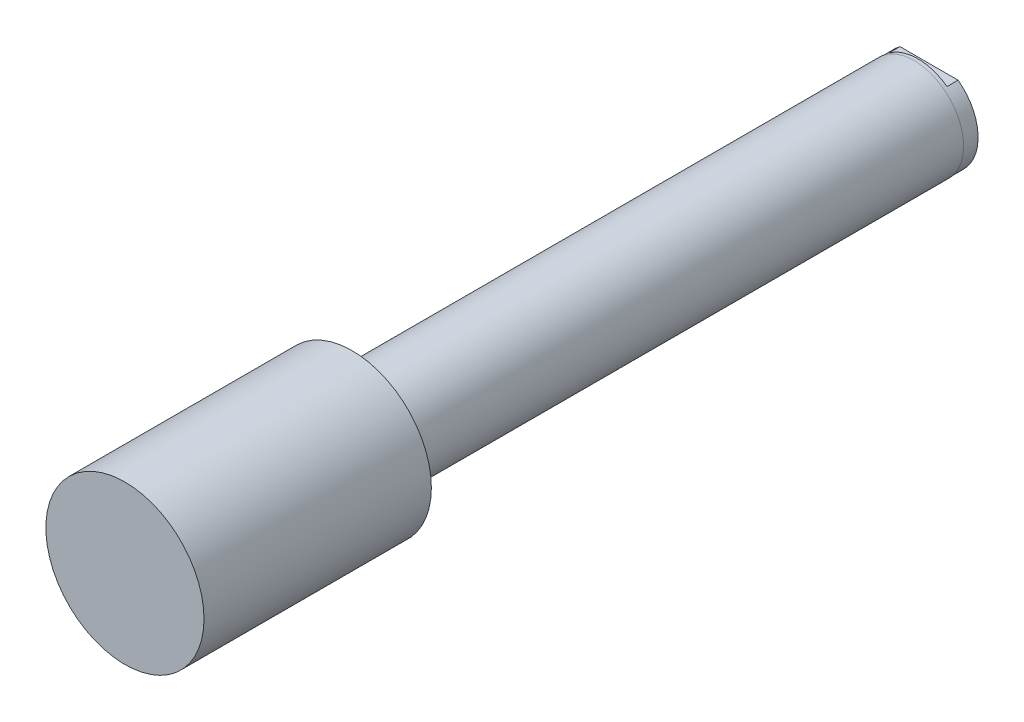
ISO-10303-21;
HEADER;
FILE_DESCRIPTION(('STEP AP214'),'2;1');
FILE_NAME('part.step','',(''),(''),'','','');
FILE_SCHEMA(('AUTOMOTIVE_DESIGN { 1 0 10303 214 1 1 1 1 }'));
ENDSEC;
DATA;
#1=APPLICATION_CONTEXT('core data for automotive mechanical design processes');
#2=APPLICATION_PROTOCOL_DEFINITION('international standard','automotive_design',2000,#1);
#3=PRODUCT_CONTEXT('',#1,'mechanical');
#4=PRODUCT('Part','Part','',(#3));
#5=PRODUCT_RELATED_PRODUCT_CATEGORY('part','',(#4));
#6=PRODUCT_DEFINITION_FORMATION('','',#4);
#7=PRODUCT_DEFINITION_CONTEXT('part definition',#1,'design');
#8=PRODUCT_DEFINITION('design','',#6,#7);
#9=PRODUCT_DEFINITION_SHAPE('','',#8);
#10=(LENGTH_UNIT() NAMED_UNIT(*) SI_UNIT(.MILLI.,.METRE.));
#11=(NAMED_UNIT(*) PLANE_ANGLE_UNIT() SI_UNIT($,.RADIAN.));
#12=(NAMED_UNIT(*) SI_UNIT($,.STERADIAN.) SOLID_ANGLE_UNIT());
#13=UNCERTAINTY_MEASURE_WITH_UNIT(LENGTH_MEASURE(1.E-05),#10,'distance_accuracy_value','');
#14=(GEOMETRIC_REPRESENTATION_CONTEXT(3) GLOBAL_UNCERTAINTY_ASSIGNED_CONTEXT((#13)) GLOBAL_UNIT_ASSIGNED_CONTEXT((#10,
#11,#12)) REPRESENTATION_CONTEXT('',''));
#15=CARTESIAN_POINT('',(0.,0.,0.));
#16=DIRECTION('',(0.,0.,1.));
#17=DIRECTION('',(1.,0.,0.));
#18=AXIS2_PLACEMENT_3D('',#15,#16,#17);
#19=CARTESIAN_POINT('',(0.,0.,258.2672));
#20=DIRECTION('',(0.,0.,1.));
#21=DIRECTION('',(1.,0.,0.));
#22=AXIS2_PLACEMENT_3D('',#19,#20,#21);
#23=PLANE('',#22);
#24=CARTESIAN_POINT('',(0.,0.,258.2672));
#25=DIRECTION('',(0.,0.,1.));
#26=DIRECTION('',(1.,0.,0.));
#27=AXIS2_PLACEMENT_3D('',#24,#25,#26);
#28=CIRCLE('',#27,25.4);
#29=CARTESIAN_POINT('',(25.4,0.,258.2672));
#30=VERTEX_POINT('',#29);
#31=EDGE_CURVE('E104',#30,#30,#28,.T.);
#32=ORIENTED_EDGE('',*,*,#31,.T.);
#33=EDGE_LOOP('',(#32));
#34=FACE_BOUND('',#33,.T.);
#35=ADVANCED_FACE('F16',(#34),#23,.T.);
#36=CARTESIAN_POINT('',(0.,0.,258.2672));
#37=DIRECTION('',(0.,0.,-1.));
#38=DIRECTION('',(-1.,0.,0.));
#39=AXIS2_PLACEMENT_3D('',#36,#37,#38);
#40=CYLINDRICAL_SURFACE('',#39,25.4);
#41=ORIENTED_EDGE('',*,*,#31,.F.);
#42=EDGE_LOOP('',(#41));
#43=FACE_BOUND('',#42,.T.);
#44=CARTESIAN_POINT('',(0.,0.,185.2422));
#45=DIRECTION('',(0.,0.,1.));
#46=DIRECTION('',(1.,0.,0.));
#47=AXIS2_PLACEMENT_3D('',#44,#45,#46);
#48=CIRCLE('',#47,25.4);
#49=CARTESIAN_POINT('',(25.4,0.,185.2422));
#50=VERTEX_POINT('',#49);
#51=EDGE_CURVE('E101',#50,#50,#48,.T.);
#52=ORIENTED_EDGE('',*,*,#51,.T.);
#53=EDGE_LOOP('',(#52));
#54=FACE_BOUND('',#53,.T.);
#55=ADVANCED_FACE('F165',(#43,#54),#40,.T.);
#56=CARTESIAN_POINT('',(0.,0.,185.2422));
#57=DIRECTION('',(0.,0.,1.));
#58=DIRECTION('',(1.,0.,0.));
#59=AXIS2_PLACEMENT_3D('',#56,#57,#58);
#60=PLANE('',#59);
#61=CARTESIAN_POINT('',(0.,0.,185.2422));
#62=DIRECTION('',(0.,0.,1.));
#63=DIRECTION('',(1.,0.,0.));
#64=AXIS2_PLACEMENT_3D('',#61,#62,#63);
#65=CIRCLE('',#64,15.875);
#66=CARTESIAN_POINT('',(15.875,0.,185.2422));
#67=VERTEX_POINT('',#66);
#68=EDGE_CURVE('E109',#67,#67,#65,.F.);
#69=ORIENTED_EDGE('',*,*,#68,.F.);
#70=EDGE_LOOP('',(#69));
#71=FACE_BOUND('',#70,.T.);
#72=ORIENTED_EDGE('',*,*,#51,.F.);
#73=EDGE_LOOP('',(#72));
#74=FACE_BOUND('',#73,.T.);
#75=ADVANCED_FACE('F161',(#71,#74),#60,.F.);
#76=CARTESIAN_POINT('',(0.,0.,185.2422));
#77=DIRECTION('',(0.,0.,-1.));
#78=DIRECTION('',(-1.,0.,0.));
#79=AXIS2_PLACEMENT_3D('',#76,#77,#78);
#80=CYLINDRICAL_SURFACE('',#79,15.875);
#81=CARTESIAN_POINT('',(0.,0.,4.7752));
#82=DIRECTION('',(0.,0.,-1.));
#83=DIRECTION('',(-1.,0.,0.));
#84=AXIS2_PLACEMENT_3D('',#81,#82,#83);
#85=CIRCLE('',#84,15.875);
#86=CARTESIAN_POINT('',(-15.875,0.,4.7752));
#87=VERTEX_POINT('',#86);
#88=EDGE_CURVE('E25',#87,#87,#85,.T.);
#89=ORIENTED_EDGE('',*,*,#88,.F.);
#90=EDGE_LOOP('',(#89));
#91=FACE_BOUND('',#90,.T.);
#92=ORIENTED_EDGE('',*,*,#68,.T.);
#93=EDGE_LOOP('',(#92));
#94=FACE_BOUND('',#93,.T.);
#95=ADVANCED_FACE('F144',(#91,#94),#80,.T.);
#96=CARTESIAN_POINT('',(0.,0.,4.7752));
#97=DIRECTION('',(0.,0.,-1.));
#98=DIRECTION('',(-1.,0.,0.));
#99=AXIS2_PLACEMENT_3D('',#96,#97,#98);
#100=PLANE('',#99);
#101=ORIENTED_EDGE('',*,*,#88,.T.);
#102=EDGE_LOOP('',(#101));
#103=FACE_BOUND('',#102,.T.);
#104=CARTESIAN_POINT('',(0.,0.,4.7752));
#105=DIRECTION('',(0.,0.,-1.));
#106=DIRECTION('',(0.,1.,0.));
#107=AXIS2_PLACEMENT_3D('',#104,#105,#106);
#108=CIRCLE('',#107,15.7607);
#109=CARTESIAN_POINT('',(0.,15.7607,4.7752));
#110=VERTEX_POINT('',#109);
#111=EDGE_CURVE('E10',#110,#110,#108,.T.);
#112=ORIENTED_EDGE('',*,*,#111,.F.);
#113=EDGE_LOOP('',(#112));
#114=FACE_BOUND('',#113,.T.);
#115=ADVANCED_FACE('F148',(#103,#114),#100,.T.);
#116=CARTESIAN_POINT('',(0.,0.,32.512));
#117=DIRECTION('',(0.,0.,-1.));
#118=DIRECTION('',(1.,0.,0.));
#119=AXIS2_PLACEMENT_3D('',#116,#117,#118);
#120=CONICAL_SURFACE('',#119,4.96062,1.02974425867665);
#121=CARTESIAN_POINT('',(0.,0.,35.4926412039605));
#122=VERTEX_POINT('',#121);
#123=VERTEX_LOOP('',#122);
#124=FACE_BOUND('',#123,.T.);
#125=CARTESIAN_POINT('',(0.,0.,32.512));
#126=DIRECTION('',(0.,0.,-1.));
#127=DIRECTION('',(1.,0.,0.));
#128=AXIS2_PLACEMENT_3D('',#125,#126,#127);
#129=CIRCLE('',#128,4.96062);
#130=CARTESIAN_POINT('',(4.96062,0.,32.512));
#131=VERTEX_POINT('',#130);
#132=EDGE_CURVE('E92',#131,#131,#129,.T.);
#133=ORIENTED_EDGE('',*,*,#132,.T.);
#134=EDGE_LOOP('',(#133));
#135=FACE_BOUND('',#134,.T.);
#136=ADVANCED_FACE('F131',(#124,#135),#120,.F.);
#137=CARTESIAN_POINT('',(0.,0.,0.));
#138=DIRECTION('',(0.,0.,-1.));
#139=DIRECTION('',(1.,0.,0.));
#140=AXIS2_PLACEMENT_3D('',#137,#138,#139);
#141=CYLINDRICAL_SURFACE('',#140,4.96062);
#142=ORIENTED_EDGE('',*,*,#132,.F.);
#143=EDGE_LOOP('',(#142));
#144=FACE_BOUND('',#143,.T.);
#145=CARTESIAN_POINT('',(0.,0.,0.));
#146=DIRECTION('',(0.,0.,-1.));
#147=DIRECTION('',(1.,0.,0.));
#148=AXIS2_PLACEMENT_3D('',#145,#146,#147);
#149=CIRCLE('',#148,4.96062);
#150=CARTESIAN_POINT('',(4.96062,0.,0.));
#151=VERTEX_POINT('',#150);
#152=EDGE_CURVE('E95',#151,#151,#149,.T.);
#153=ORIENTED_EDGE('',*,*,#152,.T.);
#154=EDGE_LOOP('',(#153));
#155=FACE_BOUND('',#154,.T.);
#156=ADVANCED_FACE('F122',(#144,#155),#141,.F.);
#157=CARTESIAN_POINT('',(0.,0.,3.556));
#158=DIRECTION('',(0.,0.,-1.));
#159=DIRECTION('',(1.,0.,0.));
#160=AXIS2_PLACEMENT_3D('',#157,#158,#159);
#161=PLANE('',#160);
#162=CARTESIAN_POINT('',(0.,0.,3.556));
#163=DIRECTION('',(0.,0.,-1.));
#164=DIRECTION('',(1.,0.,0.));
#165=AXIS2_PLACEMENT_3D('',#162,#163,#164);
#166=CIRCLE('',#165,15.7607);
#167=CARTESIAN_POINT('',(-9.33325583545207,12.7,3.556));
#168=VERTEX_POINT('',#167);
#169=CARTESIAN_POINT('',(9.33325583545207,12.7,3.556));
#170=VERTEX_POINT('',#169);
#171=EDGE_CURVE('E65',#168,#170,#166,.T.);
#172=ORIENTED_EDGE('',*,*,#171,.T.);
#173=DIRECTION('',(-1.,0.,0.));
#174=VECTOR('',#173,1.);
#175=CARTESIAN_POINT('',(-9.33325583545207,12.7,3.556));
#176=LINE('',#175,#174);
#177=EDGE_CURVE('E67',#170,#168,#176,.T.);
#178=ORIENTED_EDGE('',*,*,#177,.T.);
#179=EDGE_LOOP('',(#172,#178));
#180=FACE_BOUND('',#179,.T.);
#181=ADVANCED_FACE('F66',(#180),#161,.T.);
#182=CARTESIAN_POINT('',(0.,0.,3.556));
#183=DIRECTION('',(0.,0.,-1.));
#184=DIRECTION('',(1.,0.,0.));
#185=AXIS2_PLACEMENT_3D('',#182,#183,#184);
#186=PLANE('',#185);
#187=CARTESIAN_POINT('',(0.,0.,3.556));
#188=DIRECTION('',(0.,0.,-1.));
#189=DIRECTION('',(1.,0.,0.));
#190=AXIS2_PLACEMENT_3D('',#187,#188,#189);
#191=CIRCLE('',#190,15.7607);
#192=CARTESIAN_POINT('',(9.33325583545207,-12.7,3.556));
#193=VERTEX_POINT('',#192);
#194=CARTESIAN_POINT('',(-9.33325583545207,-12.7,3.556));
#195=VERTEX_POINT('',#194);
#196=EDGE_CURVE('E84',#193,#195,#191,.T.);
#197=ORIENTED_EDGE('',*,*,#196,.T.);
#198=DIRECTION('',(1.,0.,0.));
#199=VECTOR('',#198,1.);
#200=CARTESIAN_POINT('',(-9.33325583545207,-12.7,3.556));
#201=LINE('',#200,#199);
#202=EDGE_CURVE('E86',#195,#193,#201,.T.);
#203=ORIENTED_EDGE('',*,*,#202,.T.);
#204=EDGE_LOOP('',(#197,#203));
#205=FACE_BOUND('',#204,.T.);
#206=ADVANCED_FACE('F117',(#205),#186,.T.);
#207=CARTESIAN_POINT('',(-9.33325583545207,-12.7,3.556));
#208=DIRECTION('',(0.,1.,0.));
#209=DIRECTION('',(0.,0.,1.));
#210=AXIS2_PLACEMENT_3D('',#207,#208,#209);
#211=PLANE('',#210);
#212=DIRECTION('',(1.,0.,0.));
#213=VECTOR('',#212,1.);
#214=CARTESIAN_POINT('',(-9.33325583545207,-12.7,0.));
#215=LINE('',#214,#213);
#216=CARTESIAN_POINT('',(-9.33325583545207,-12.7,0.));
#217=VERTEX_POINT('',#216);
#218=CARTESIAN_POINT('',(9.33325583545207,-12.7,0.));
#219=VERTEX_POINT('',#218);
#220=EDGE_CURVE('E80',#217,#219,#215,.T.);
#221=ORIENTED_EDGE('',*,*,#220,.T.);
#222=DIRECTION('',(0.,0.,-1.));
#223=VECTOR('',#222,1.);
#224=CARTESIAN_POINT('',(9.33325583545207,-12.7,3.556));
#225=LINE('',#224,#223);
#226=EDGE_CURVE('E90',#193,#219,#225,.T.);
#227=ORIENTED_EDGE('',*,*,#226,.F.);
#228=ORIENTED_EDGE('',*,*,#202,.F.);
#229=DIRECTION('',(0.,0.,-1.));
#230=VECTOR('',#229,1.);
#231=CARTESIAN_POINT('',(-9.33325583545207,-12.7,3.556));
#232=LINE('',#231,#230);
#233=EDGE_CURVE('E41',#195,#217,#232,.T.);
#234=ORIENTED_EDGE('',*,*,#233,.T.);
#235=EDGE_LOOP('',(#221,#227,#228,#234));
#236=FACE_BOUND('',#235,.T.);
#237=ADVANCED_FACE('F118',(#236),#211,.F.);
#238=CARTESIAN_POINT('',(0.,0.,0.));
#239=DIRECTION('',(0.,0.,-1.));
#240=DIRECTION('',(1.,0.,0.));
#241=AXIS2_PLACEMENT_3D('',#238,#239,#240);
#242=PLANE('',#241);
#243=DIRECTION('',(-1.,0.,0.));
#244=VECTOR('',#243,1.);
#245=CARTESIAN_POINT('',(-9.33325583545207,12.7,0.));
#246=LINE('',#245,#244);
#247=CARTESIAN_POINT('',(9.33325583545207,12.7,0.));
#248=VERTEX_POINT('',#247);
#249=CARTESIAN_POINT('',(-9.33325583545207,12.7,0.));
#250=VERTEX_POINT('',#249);
#251=EDGE_CURVE('E70',#248,#250,#246,.T.);
#252=ORIENTED_EDGE('',*,*,#251,.F.);
#253=CARTESIAN_POINT('',(0.,0.,0.));
#254=DIRECTION('',(0.,0.,-1.));
#255=DIRECTION('',(1.,0.,0.));
#256=AXIS2_PLACEMENT_3D('',#253,#254,#255);
#257=CIRCLE('',#256,15.7607);
#258=EDGE_CURVE('E78',#248,#219,#257,.T.);
#259=ORIENTED_EDGE('',*,*,#258,.T.);
#260=ORIENTED_EDGE('',*,*,#220,.F.);
#261=EDGE_CURVE('E20',#217,#250,#257,.T.);
#262=ORIENTED_EDGE('',*,*,#261,.T.);
#263=EDGE_LOOP('',(#252,#259,#260,#262));
#264=FACE_BOUND('',#263,.T.);
#265=ORIENTED_EDGE('',*,*,#152,.F.);
#266=EDGE_LOOP('',(#265));
#267=FACE_BOUND('',#266,.T.);
#268=ADVANCED_FACE('F119',(#264,#267),#242,.T.);
#269=CARTESIAN_POINT('',(-9.33325583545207,12.7,3.556));
#270=DIRECTION('',(0.,-1.,0.));
#271=DIRECTION('',(0.,0.,-1.));
#272=AXIS2_PLACEMENT_3D('',#269,#270,#271);
#273=PLANE('',#272);
#274=ORIENTED_EDGE('',*,*,#251,.T.);
#275=DIRECTION('',(0.,0.,-1.));
#276=VECTOR('',#275,1.);
#277=CARTESIAN_POINT('',(-9.33325583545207,12.7,3.556));
#278=LINE('',#277,#276);
#279=EDGE_CURVE('E73',#168,#250,#278,.T.);
#280=ORIENTED_EDGE('',*,*,#279,.F.);
#281=ORIENTED_EDGE('',*,*,#177,.F.);
#282=DIRECTION('',(0.,0.,-1.));
#283=VECTOR('',#282,1.);
#284=CARTESIAN_POINT('',(9.33325583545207,12.7,3.556));
#285=LINE('',#284,#283);
#286=EDGE_CURVE('E33',#170,#248,#285,.T.);
#287=ORIENTED_EDGE('',*,*,#286,.T.);
#288=EDGE_LOOP('',(#274,#280,#281,#287));
#289=FACE_BOUND('',#288,.T.);
#290=ADVANCED_FACE('F72',(#289),#273,.F.);
#291=CARTESIAN_POINT('',(0.,0.,4.7752));
#292=DIRECTION('',(0.,0.,-1.));
#293=DIRECTION('',(1.,0.,0.));
#294=AXIS2_PLACEMENT_3D('',#291,#292,#293);
#295=CYLINDRICAL_SURFACE('',#294,15.7607);
#296=ORIENTED_EDGE('',*,*,#279,.T.);
#297=ORIENTED_EDGE('',*,*,#261,.F.);
#298=ORIENTED_EDGE('',*,*,#233,.F.);
#299=ORIENTED_EDGE('',*,*,#196,.F.);
#300=ORIENTED_EDGE('',*,*,#226,.T.);
#301=ORIENTED_EDGE('',*,*,#258,.F.);
#302=ORIENTED_EDGE('',*,*,#286,.F.);
#303=ORIENTED_EDGE('',*,*,#171,.F.);
#304=EDGE_LOOP('',(#296,#297,#298,#299,#300,#301,#302,#303));
#305=FACE_BOUND('',#304,.T.);
#306=ORIENTED_EDGE('',*,*,#111,.T.);
#307=EDGE_LOOP('',(#306));
#308=FACE_BOUND('',#307,.T.);
#309=ADVANCED_FACE('F18',(#305,#308),#295,.T.);
#310=CLOSED_SHELL('',(#35,#55,#75,#95,#115,#136,#156,#181,#206,#237,#268,#290,#309));
#311=MANIFOLD_SOLID_BREP('B1',#310);
#312=ADVANCED_BREP_SHAPE_REPRESENTATION('',(#18,#311),#14);
#313=SHAPE_DEFINITION_REPRESENTATION(#9,#312);
ENDSEC;
END-ISO-10303-21;
